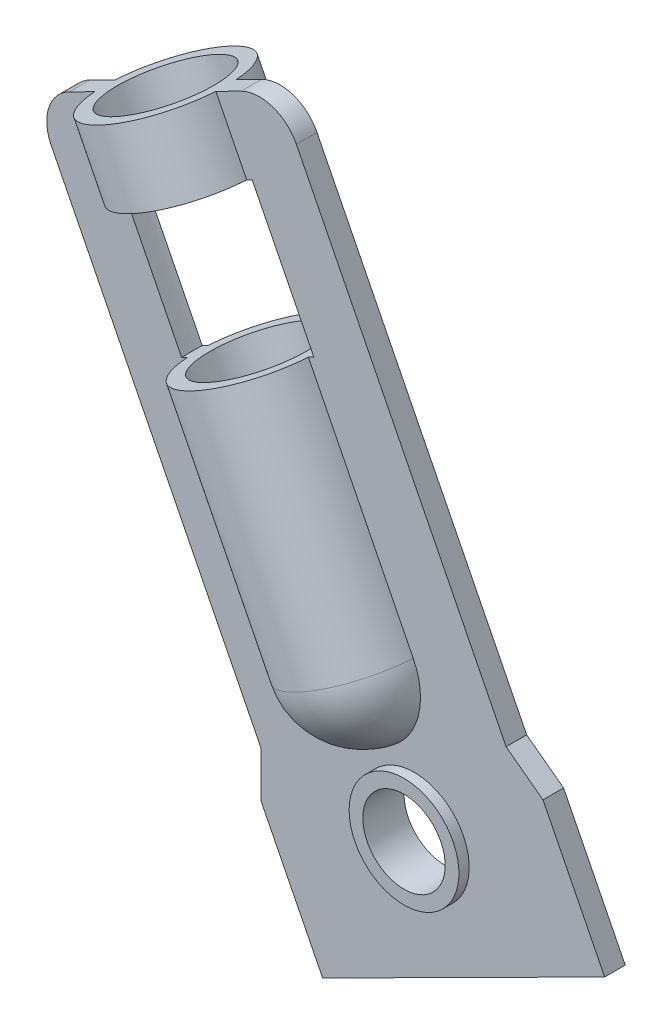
from build123d import *

# Parameters (mm, degrees)
ESQUISSE2_R      = 3
EXTRUSION1_DEPTH = 0.75
EXTRUSION2_START = -2.25
ESQUISSE3_R      = 4
ESQUISSE3_R_2    = 3
EXTRUSION2_DEPTH = 3


with BuildPart() as part:
    # Esquisse2 → Extrusion1 (new, symmetric)
    with BuildSketch(Plane.XY.offset(18.5)):
        with BuildLine():
            Line((-6.253401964, 73.823005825), (6.253401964, 80.114258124))
            ThreePointArc((6.253401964, 80.114258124), (8.543325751, 80.282564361), (10.28155687, 78.782354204))
            Line((10.28155687, 78.782354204), (25.560312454, 48.40868752))
            Line((25.560312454, 48.40868752), (28.248452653, 46.402720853))
            Line((28.248452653, 46.402720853), (32.742204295, 37.469289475))
            Line((32.742204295, 37.469289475), (12.195312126, 27.133660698))
            Line((12.195312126, 27.133660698), (7.701560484, 36.067092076))
            Line((7.701560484, 36.067092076), (7.693449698, 39.421184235))
            Line((7.693449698, 39.421184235), (-7.585305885, 69.794850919))
            ThreePointArc((-7.585305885, 69.794850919), (-7.753612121, 72.084774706), (-6.253401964, 73.823005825))
        make_face()
        with Locations((18.873756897, 39.448220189)):
            Circle(ESQUISSE2_R, mode=Mode.SUBTRACT)
    extrude(amount=EXTRUSION1_DEPTH, both=True)

    # Esquisse3 → Extrusion2 (add)
    with BuildSketch(Plane.XY.offset(19.25).offset(EXTRUSION2_START)):
        with Locations(Location((18.873756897, 39.448220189, 0), (0, 0, 180))):
            Circle(ESQUISSE3_R)
        with Locations(Location((18.873756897, 39.448220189, 0), (0, 0, 180))):
            Circle(ESQUISSE3_R_2, mode=Mode.SUBTRACT)
    extrude(amount=EXTRUSION2_DEPTH)

    # Esquisse4 → R_volution1 (revolve)
    with BuildSketch(Plane.XY.offset(18.5)):
        with BuildLine():
            Line((0, 76.968631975), (4.466715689, 79.215507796))
            Line((4.466715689, 79.215507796), (18.846720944, 50.628527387))
            ThreePointArc((18.846720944, 50.628527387), (19.127231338, 46.811987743), (16.626881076, 43.914935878))
            Line((16.626881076, 43.914935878), (0, 76.968631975))
        make_face()
    revolve(axis=Axis((18.873756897, 39.448220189, 18.5), (-0.44937516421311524, 0.8933431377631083, 0)))

    # Esquisse5 → Enl_vement de mati_re-R_volution1 (revolve, cut)
    with BuildSketch(Plane.XY.offset(18.5)):
        Polygon((5.769711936, 74.273995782), (7.109726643, 74.948058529), (11.603478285, 66.014627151), (10.263463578, 65.340564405), (16.879730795, 52.187641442), (14.380005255, 48.381651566), (0, 76.968631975), (3.522836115, 78.740711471), align=None)
    revolve(axis=Axis((18.873756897, 39.448220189, 18.5), (-0.4493751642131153, 0.8933431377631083, 0)), mode=Mode.SUBTRACT)


solid = part.part
